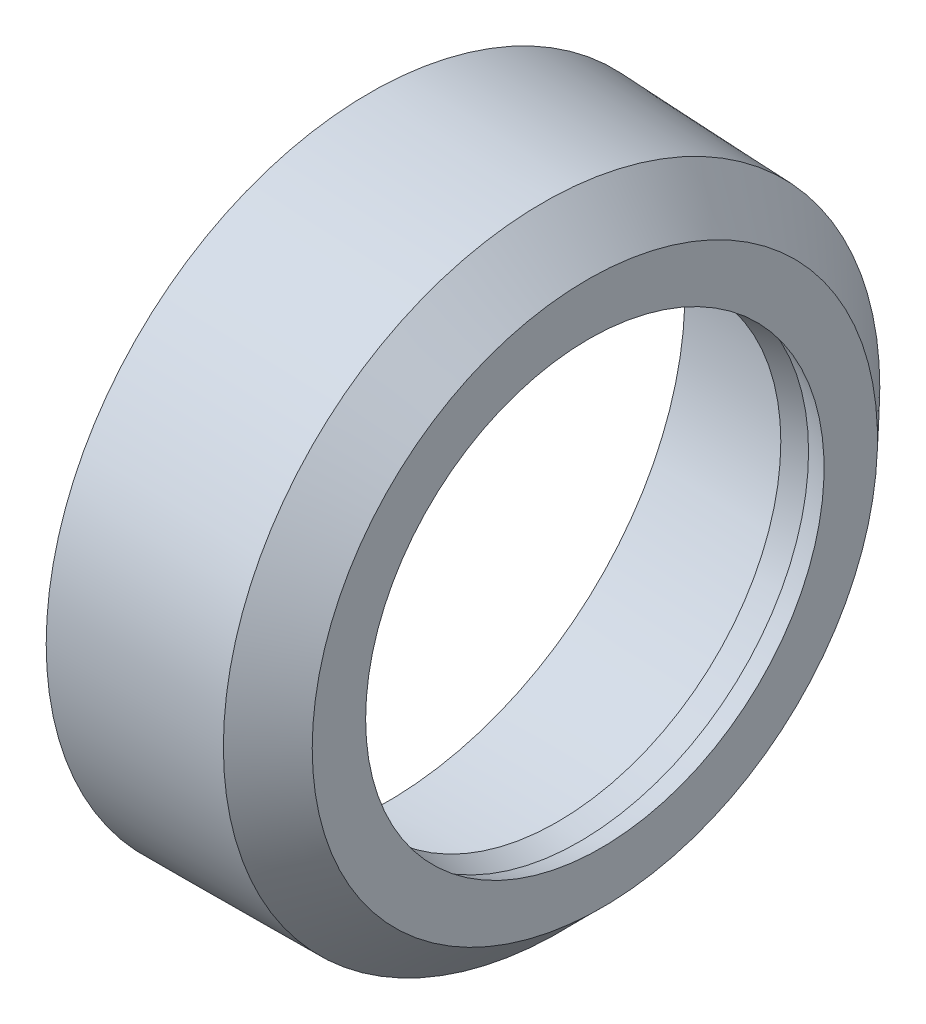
ISO-10303-21;
HEADER;
FILE_DESCRIPTION(('STEP AP214'),'2;1');
FILE_NAME('part.step','',(''),(''),'','','');
FILE_SCHEMA(('AUTOMOTIVE_DESIGN { 1 0 10303 214 1 1 1 1 }'));
ENDSEC;
DATA;
#1=APPLICATION_CONTEXT('core data for automotive mechanical design processes');
#2=APPLICATION_PROTOCOL_DEFINITION('international standard','automotive_design',2000,#1);
#3=PRODUCT_CONTEXT('',#1,'mechanical');
#4=PRODUCT('Part','Part','',(#3));
#5=PRODUCT_RELATED_PRODUCT_CATEGORY('part','',(#4));
#6=PRODUCT_DEFINITION_FORMATION('','',#4);
#7=PRODUCT_DEFINITION_CONTEXT('part definition',#1,'design');
#8=PRODUCT_DEFINITION('design','',#6,#7);
#9=PRODUCT_DEFINITION_SHAPE('','',#8);
#10=(LENGTH_UNIT() NAMED_UNIT(*) SI_UNIT(.MILLI.,.METRE.));
#11=(NAMED_UNIT(*) PLANE_ANGLE_UNIT() SI_UNIT($,.RADIAN.));
#12=(NAMED_UNIT(*) SI_UNIT($,.STERADIAN.) SOLID_ANGLE_UNIT());
#13=UNCERTAINTY_MEASURE_WITH_UNIT(LENGTH_MEASURE(1.E-05),#10,'distance_accuracy_value','');
#14=(GEOMETRIC_REPRESENTATION_CONTEXT(3) GLOBAL_UNCERTAINTY_ASSIGNED_CONTEXT((#13)) GLOBAL_UNIT_ASSIGNED_CONTEXT((#10,
#11,#12)) REPRESENTATION_CONTEXT('',''));
#15=CARTESIAN_POINT('',(0.,0.,0.));
#16=DIRECTION('',(0.,0.,1.));
#17=DIRECTION('',(1.,0.,0.));
#18=AXIS2_PLACEMENT_3D('',#15,#16,#17);
#19=CARTESIAN_POINT('',(79.7226716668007,-31.75,-35.1496237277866));
#20=DIRECTION('',(-0.999657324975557,0.,-0.0261769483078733));
#21=DIRECTION('',(-0.0261769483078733,0.,0.999657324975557));
#22=AXIS2_PLACEMENT_3D('',#19,#20,#21);
#23=CONICAL_SURFACE('',#22,18.0689110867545,0.261799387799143);
#24=CARTESIAN_POINT('',(81.4720719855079,-31.75,-35.1038140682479));
#25=DIRECTION('',(0.999657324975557,0.,0.0261769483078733));
#26=DIRECTION('',(0.0261769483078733,0.,-0.999657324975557));
#27=AXIS2_PLACEMENT_3D('',#24,#25,#26);
#28=CIRCLE('',#27,17.6);
#29=CARTESIAN_POINT('',(81.0113576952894,-31.75,-17.509845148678));
#30=VERTEX_POINT('',#29);
#31=EDGE_CURVE('E10',#30,#30,#28,.T.);
#32=CARTESIAN_POINT('',(79.7226716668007,-31.75,-35.1496237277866));
#33=DIRECTION('',(0.999657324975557,0.,0.0261769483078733));
#34=DIRECTION('',(0.0261769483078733,0.,-0.999657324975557));
#35=AXIS2_PLACEMENT_3D('',#32,#33,#34);
#36=CIRCLE('',#35,18.0689110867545);
#37=CARTESIAN_POINT('',(79.2496827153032,-31.75,-17.0869044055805));
#38=VERTEX_POINT('',#37);
#39=EDGE_CURVE('E55',#38,#38,#36,.T.);
#40=CARTESIAN_POINT('',(81.0113576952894,-31.75,-17.509845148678));
#41=CARTESIAN_POINT('',(80.9930069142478,-31.75,-17.5054395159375));
#42=CARTESIAN_POINT('',(80.9746561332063,-31.75,-17.5010338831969));
#43=CARTESIAN_POINT('',(80.9379545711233,-31.75,-17.4922226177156));
#44=CARTESIAN_POINT('',(80.9196037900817,-31.75,-17.487816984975));
#45=CARTESIAN_POINT('',(80.8829022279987,-31.75,-17.4790057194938));
#46=CARTESIAN_POINT('',(80.8645514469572,-31.75,-17.4746000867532));
#47=CARTESIAN_POINT('',(80.8278498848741,-31.75,-17.4657888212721));
#48=CARTESIAN_POINT('',(80.8094991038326,-31.75,-17.4613831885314));
#49=CARTESIAN_POINT('',(80.7727975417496,-31.75,-17.4525719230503));
#50=CARTESIAN_POINT('',(80.754446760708,-31.75,-17.4481662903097));
#51=CARTESIAN_POINT('',(80.717745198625,-31.75,-17.4393550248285));
#52=CARTESIAN_POINT('',(80.6993944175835,-31.75,-17.4349493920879));
#53=CARTESIAN_POINT('',(80.6626928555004,-31.75,-17.4261381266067));
#54=CARTESIAN_POINT('',(80.6443420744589,-31.75,-17.4217324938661));
#55=CARTESIAN_POINT('',(80.6076405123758,-31.75,-17.4129212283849));
#56=CARTESIAN_POINT('',(80.5892897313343,-31.75,-17.4085155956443));
#57=CARTESIAN_POINT('',(80.5525881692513,-31.75,-17.3997043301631));
#58=CARTESIAN_POINT('',(80.5342373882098,-31.75,-17.3952986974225));
#59=CARTESIAN_POINT('',(80.4975358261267,-31.75,-17.3864874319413));
#60=CARTESIAN_POINT('',(80.4791850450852,-31.75,-17.3820817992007));
#61=CARTESIAN_POINT('',(80.4424834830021,-31.75,-17.3732705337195));
#62=CARTESIAN_POINT('',(80.4241327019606,-31.75,-17.3688649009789));
#63=CARTESIAN_POINT('',(80.3874311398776,-31.75,-17.3600536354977));
#64=CARTESIAN_POINT('',(80.3690803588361,-31.75,-17.3556480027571));
#65=CARTESIAN_POINT('',(80.332378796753,-31.75,-17.3468367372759));
#66=CARTESIAN_POINT('',(80.3140280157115,-31.75,-17.3424311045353));
#67=CARTESIAN_POINT('',(80.2773264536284,-31.75,-17.3336198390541));
#68=CARTESIAN_POINT('',(80.2589756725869,-31.75,-17.3292142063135));
#69=CARTESIAN_POINT('',(80.2222741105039,-31.75,-17.3204029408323));
#70=CARTESIAN_POINT('',(80.2039233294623,-31.75,-17.3159973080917));
#71=CARTESIAN_POINT('',(80.1672217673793,-31.75,-17.3071860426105));
#72=CARTESIAN_POINT('',(80.1488709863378,-31.75,-17.3027804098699));
#73=CARTESIAN_POINT('',(80.1121694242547,-31.75,-17.2939691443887));
#74=CARTESIAN_POINT('',(80.0938186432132,-31.75,-17.2895635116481));
#75=CARTESIAN_POINT('',(80.0571170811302,-31.75,-17.2807522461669));
#76=CARTESIAN_POINT('',(80.0387663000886,-31.75,-17.2763466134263));
#77=CARTESIAN_POINT('',(80.0020647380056,-31.75,-17.2675353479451));
#78=CARTESIAN_POINT('',(79.9837139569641,-31.75,-17.2631297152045));
#79=CARTESIAN_POINT('',(79.947012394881,-31.75,-17.2543184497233));
#80=CARTESIAN_POINT('',(79.9286616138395,-31.75,-17.2499128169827));
#81=CARTESIAN_POINT('',(79.8919600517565,-31.75,-17.2411015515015));
#82=CARTESIAN_POINT('',(79.8736092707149,-31.75,-17.2366959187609));
#83=CARTESIAN_POINT('',(79.8369077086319,-31.75,-17.2278846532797));
#84=CARTESIAN_POINT('',(79.8185569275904,-31.75,-17.2234790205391));
#85=CARTESIAN_POINT('',(79.7818553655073,-31.75,-17.2146677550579));
#86=CARTESIAN_POINT('',(79.7635045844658,-31.75,-17.2102621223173));
#87=CARTESIAN_POINT('',(79.7268030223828,-31.75,-17.2014508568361));
#88=CARTESIAN_POINT('',(79.7084522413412,-31.75,-17.1970452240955));
#89=CARTESIAN_POINT('',(79.6717506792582,-31.75,-17.1882339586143));
#90=CARTESIAN_POINT('',(79.6533998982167,-31.75,-17.1838283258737));
#91=CARTESIAN_POINT('',(79.6166983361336,-31.75,-17.1750170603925));
#92=CARTESIAN_POINT('',(79.5983475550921,-31.75,-17.1706114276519));
#93=CARTESIAN_POINT('',(79.5616459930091,-31.75,-17.1618001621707));
#94=CARTESIAN_POINT('',(79.5432952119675,-31.75,-17.1573945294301));
#95=CARTESIAN_POINT('',(79.5065936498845,-31.75,-17.1485832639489));
#96=CARTESIAN_POINT('',(79.488242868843,-31.75,-17.1441776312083));
#97=CARTESIAN_POINT('',(79.4515413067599,-31.75,-17.1353663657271));
#98=CARTESIAN_POINT('',(79.4331905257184,-31.75,-17.1309607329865));
#99=CARTESIAN_POINT('',(79.3964889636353,-31.75,-17.1221494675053));
#100=CARTESIAN_POINT('',(79.3781381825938,-31.75,-17.1177438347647));
#101=CARTESIAN_POINT('',(79.3414366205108,-31.75,-17.1089325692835));
#102=CARTESIAN_POINT('',(79.3230858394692,-31.75,-17.1045269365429));
#103=CARTESIAN_POINT('',(79.2863842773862,-31.75,-17.0957156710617));
#104=CARTESIAN_POINT('',(79.2680334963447,-31.75,-17.0913100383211));
#105=CARTESIAN_POINT('',(79.2496827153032,-31.75,-17.0869044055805));
#106=B_SPLINE_CURVE_WITH_KNOTS('',3,(#40,#41,#42,#43,#44,#45,#46,#47,#48,#49,#50,#51,#52,#53,
#54,#55,#56,#57,#58,#59,#60,#61,#62,#63,#64,#65,#66,#67,#68,#69,#70,#71,#72,#73,#74,#75,#76,#77,
#78,#79,#80,#81,#82,#83,#84,#85,#86,#87,#88,#89,#90,#91,#92,#93,#94,#95,#96,#97,#98,#99,#100,
#101,#102,#103,#104,#105),.UNSPECIFIED.,.F.,.F.,(4,2,2,2,2,2,2,2,2,2,2,2,2,2,2,2,2,2,2,2,2,2,2,
2,2,2,2,2,2,2,2,2,4),(0.,0.0566166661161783,0.113233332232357,0.169849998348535,
0.226466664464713,0.283083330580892,0.33969999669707,0.396316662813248,0.452933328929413,
0.509549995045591,0.56616666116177,0.622783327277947,0.679399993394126,0.736016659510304,
0.792633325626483,0.849249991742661,0.905866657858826,0.962483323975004,1.01909999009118,
1.07571665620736,1.13233332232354,1.18894998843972,1.2455666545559,1.30218332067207,
1.35879998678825,1.41541665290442,1.47203331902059,1.52864998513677,1.58526665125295,
1.64188331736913,1.69849998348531,1.75511664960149,1.81173331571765),.UNSPECIFIED.);
#107=EDGE_CURVE('BSEAM27',#30,#38,#106,.T.);
#108=ORIENTED_EDGE('',*,*,#31,.T.);
#109=ORIENTED_EDGE('',*,*,#39,.F.);
#110=ORIENTED_EDGE('',*,*,#107,.T.);
#111=ORIENTED_EDGE('',*,*,#107,.F.);
#112=EDGE_LOOP('',(#108,#110,#109,#111));
#113=FACE_BOUND('',#112,.T.);
#114=ADVANCED_FACE('F27',(#113),#23,.F.);
#115=CARTESIAN_POINT('',(81.4720719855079,-10.0494835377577,-35.1038140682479));
#116=DIRECTION('',(0.999657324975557,0.,0.0261769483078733));
#117=DIRECTION('',(0.0261769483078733,0.,-0.999657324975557));
#118=AXIS2_PLACEMENT_3D('',#115,#116,#117);
#119=PLANE('',#118);
#120=CARTESIAN_POINT('',(81.4720719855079,-31.75,-35.1038140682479));
#121=DIRECTION('',(0.999657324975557,0.,0.0261769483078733));
#122=DIRECTION('',(0.0261769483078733,0.,-0.999657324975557));
#123=AXIS2_PLACEMENT_3D('',#120,#121,#122);
#124=CIRCLE('',#123,21.7005164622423);
#125=CARTESIAN_POINT('',(80.9040186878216,-31.75,-13.4107338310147));
#126=VERTEX_POINT('',#125);
#127=EDGE_CURVE('E33',#126,#126,#124,.T.);
#128=ORIENTED_EDGE('',*,*,#127,.T.);
#129=EDGE_LOOP('',(#128));
#130=FACE_BOUND('',#129,.T.);
#131=ORIENTED_EDGE('',*,*,#31,.F.);
#132=EDGE_LOOP('',(#131));
#133=FACE_BOUND('',#132,.T.);
#134=ADVANCED_FACE('F63',(#130,#133),#119,.T.);
#135=CARTESIAN_POINT('',(81.4720719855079,-31.75,-35.1038140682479));
#136=DIRECTION('',(-0.999657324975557,0.,-0.0261769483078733));
#137=DIRECTION('',(-0.0261769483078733,0.,0.999657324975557));
#138=AXIS2_PLACEMENT_3D('',#135,#136,#137);
#139=CONICAL_SURFACE('',#138,21.7005164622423,0.785398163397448);
#140=CARTESIAN_POINT('',(77.9732713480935,-31.75,-35.1954333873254));
#141=DIRECTION('',(0.999657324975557,0.,0.0261769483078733));
#142=DIRECTION('',(0.0261769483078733,0.,-0.999657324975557));
#143=AXIS2_PLACEMENT_3D('',#140,#141,#142);
#144=CIRCLE('',#143,25.2005164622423);
#145=CARTESIAN_POINT('',(77.3135987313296,-31.75,-10.0035525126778));
#146=VERTEX_POINT('',#145);
#147=EDGE_CURVE('E37',#146,#146,#144,.T.);
#148=CARTESIAN_POINT('',(77.3135987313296,-31.75,-10.0035525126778));
#149=CARTESIAN_POINT('',(77.3509989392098,-31.75,-10.0390439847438));
#150=CARTESIAN_POINT('',(77.3883991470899,-31.75,-10.0745354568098));
#151=CARTESIAN_POINT('',(77.4631995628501,-31.75,-10.1455184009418));
#152=CARTESIAN_POINT('',(77.5005997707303,-31.75,-10.1810098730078));
#153=CARTESIAN_POINT('',(77.5754001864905,-31.75,-10.2519928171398));
#154=CARTESIAN_POINT('',(77.6128003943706,-31.75,-10.2874842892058));
#155=CARTESIAN_POINT('',(77.6876008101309,-31.75,-10.3584672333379));
#156=CARTESIAN_POINT('',(77.725001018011,-31.75,-10.3939587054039));
#157=CARTESIAN_POINT('',(77.7998014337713,-31.75,-10.4649416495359));
#158=CARTESIAN_POINT('',(77.8372016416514,-31.75,-10.5004331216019));
#159=CARTESIAN_POINT('',(77.9120020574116,-31.75,-10.5714160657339));
#160=CARTESIAN_POINT('',(77.9494022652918,-31.75,-10.6069075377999));
#161=CARTESIAN_POINT('',(78.024202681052,-31.75,-10.6778904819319));
#162=CARTESIAN_POINT('',(78.0616028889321,-31.75,-10.713381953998));
#163=CARTESIAN_POINT('',(78.1364033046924,-31.75,-10.78436489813));
#164=CARTESIAN_POINT('',(78.1738035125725,-31.75,-10.819856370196));
#165=CARTESIAN_POINT('',(78.2486039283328,-31.75,-10.890839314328));
#166=CARTESIAN_POINT('',(78.2860041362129,-31.75,-10.926330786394));
#167=CARTESIAN_POINT('',(78.3608045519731,-31.75,-10.997313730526));
#168=CARTESIAN_POINT('',(78.3982047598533,-31.75,-11.032805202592));
#169=CARTESIAN_POINT('',(78.4730051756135,-31.75,-11.1037881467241));
#170=CARTESIAN_POINT('',(78.5104053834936,-31.75,-11.1392796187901));
#171=CARTESIAN_POINT('',(78.5852057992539,-31.75,-11.2102625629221));
#172=CARTESIAN_POINT('',(78.622606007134,-31.75,-11.2457540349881));
#173=CARTESIAN_POINT('',(78.6974064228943,-31.75,-11.3167369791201));
#174=CARTESIAN_POINT('',(78.7348066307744,-31.75,-11.3522284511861));
#175=CARTESIAN_POINT('',(78.8096070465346,-31.75,-11.4232113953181));
#176=CARTESIAN_POINT('',(78.8470072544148,-31.75,-11.4587028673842));
#177=CARTESIAN_POINT('',(78.921807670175,-31.75,-11.5296858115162));
#178=CARTESIAN_POINT('',(78.9592078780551,-31.75,-11.5651772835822));
#179=CARTESIAN_POINT('',(79.0340082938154,-31.75,-11.6361602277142));
#180=CARTESIAN_POINT('',(79.0714085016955,-31.75,-11.6716516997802));
#181=CARTESIAN_POINT('',(79.1462089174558,-31.75,-11.7426346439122));
#182=CARTESIAN_POINT('',(79.1836091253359,-31.75,-11.7781261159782));
#183=CARTESIAN_POINT('',(79.2584095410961,-31.75,-11.8491090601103));
#184=CARTESIAN_POINT('',(79.2958097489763,-31.75,-11.8846005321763));
#185=CARTESIAN_POINT('',(79.3706101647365,-31.75,-11.9555834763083));
#186=CARTESIAN_POINT('',(79.4080103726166,-31.75,-11.9910749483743));
#187=CARTESIAN_POINT('',(79.4828107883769,-31.75,-12.0620578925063));
#188=CARTESIAN_POINT('',(79.520210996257,-31.75,-12.0975493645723));
#189=CARTESIAN_POINT('',(79.5950114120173,-31.75,-12.1685323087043));
#190=CARTESIAN_POINT('',(79.6324116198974,-31.75,-12.2040237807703));
#191=CARTESIAN_POINT('',(79.7072120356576,-31.75,-12.2750067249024));
#192=CARTESIAN_POINT('',(79.7446122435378,-31.75,-12.3104981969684));
#193=CARTESIAN_POINT('',(79.819412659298,-31.75,-12.3814811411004));
#194=CARTESIAN_POINT('',(79.8568128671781,-31.75,-12.4169726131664));
#195=CARTESIAN_POINT('',(79.9316132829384,-31.75,-12.4879555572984));
#196=CARTESIAN_POINT('',(79.9690134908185,-31.75,-12.5234470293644));
#197=CARTESIAN_POINT('',(80.0438139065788,-31.75,-12.5944299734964));
#198=CARTESIAN_POINT('',(80.0812141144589,-31.75,-12.6299214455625));
#199=CARTESIAN_POINT('',(80.1560145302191,-31.75,-12.7009043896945));
#200=CARTESIAN_POINT('',(80.1934147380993,-31.75,-12.7363958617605));
#201=CARTESIAN_POINT('',(80.2682151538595,-31.75,-12.8073788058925));
#202=CARTESIAN_POINT('',(80.3056153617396,-31.75,-12.8428702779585));
#203=CARTESIAN_POINT('',(80.3804157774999,-31.75,-12.9138532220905));
#204=CARTESIAN_POINT('',(80.41781598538,-31.75,-12.9493446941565));
#205=CARTESIAN_POINT('',(80.4926164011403,-31.75,-13.0203276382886));
#206=CARTESIAN_POINT('',(80.5300166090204,-31.75,-13.0558191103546));
#207=CARTESIAN_POINT('',(80.6048170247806,-31.75,-13.1268020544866));
#208=CARTESIAN_POINT('',(80.6422172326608,-31.75,-13.1622935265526));
#209=CARTESIAN_POINT('',(80.717017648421,-31.75,-13.2332764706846));
#210=CARTESIAN_POINT('',(80.7544178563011,-31.75,-13.2687679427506));
#211=CARTESIAN_POINT('',(80.8292182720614,-31.75,-13.3397508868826));
#212=CARTESIAN_POINT('',(80.8666184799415,-31.75,-13.3752423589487));
#213=CARTESIAN_POINT('',(80.9040186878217,-31.75,-13.4107338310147));
#214=B_SPLINE_CURVE_WITH_KNOTS('',3,(#148,#149,#150,#151,#152,#153,#154,#155,#156,#157,#158,
#159,#160,#161,#162,#163,#164,#165,#166,#167,#168,#169,#170,#171,#172,#173,#174,#175,#176,#177,
#178,#179,#180,#181,#182,#183,#184,#185,#186,#187,#188,#189,#190,#191,#192,#193,#194,#195,#196,
#197,#198,#199,#200,#201,#202,#203,#204,#205,#206,#207,#208,#209,#210,#211,#212,#213),
.UNSPECIFIED.,.F.,.F.,(4,2,2,2,2,2,2,2,2,2,2,2,2,2,2,2,2,2,2,2,2,2,2,2,2,2,2,2,2,2,2,2,4),(0.,
0.15467960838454,0.309359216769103,0.464038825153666,0.618718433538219,0.773398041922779,
0.92807765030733,1.08275725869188,1.23743686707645,1.39211647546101,1.54679608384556,
1.70147569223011,1.85615530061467,2.01083490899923,2.16551451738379,2.32019412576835,
2.47487373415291,2.62955334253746,2.78423295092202,2.93891255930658,3.09359216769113,
3.2482717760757,3.40295138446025,3.5576309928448,3.71231060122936,3.86699020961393,
4.02166981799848,4.17634942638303,4.33102903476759,4.48570864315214,4.6403882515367,
4.79506785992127,4.94974746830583),.UNSPECIFIED.);
#215=EDGE_CURVE('BSEAM67',#146,#126,#214,.T.);
#216=ORIENTED_EDGE('',*,*,#147,.T.);
#217=ORIENTED_EDGE('',*,*,#127,.F.);
#218=ORIENTED_EDGE('',*,*,#215,.T.);
#219=ORIENTED_EDGE('',*,*,#215,.F.);
#220=EDGE_LOOP('',(#216,#218,#217,#219));
#221=FACE_BOUND('',#220,.T.);
#222=ADVANCED_FACE('F67',(#221),#139,.T.);
#223=CARTESIAN_POINT('',(77.9732713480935,-31.75,-35.1954333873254));
#224=DIRECTION('',(-0.999657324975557,0.,-0.0261769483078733));
#225=DIRECTION('',(-0.0261769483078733,0.,0.999657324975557));
#226=AXIS2_PLACEMENT_3D('',#223,#224,#225);
#227=CONICAL_SURFACE('',#226,25.2005164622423,0.0227233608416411);
#228=CARTESIAN_POINT('',(63.9780687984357,-31.75,-35.5619106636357));
#229=DIRECTION('',(0.999657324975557,0.,0.0261769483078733));
#230=DIRECTION('',(0.0261769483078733,0.,-0.999657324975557));
#231=AXIS2_PLACEMENT_3D('',#228,#229,#230);
#232=CIRCLE('',#231,25.5186982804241);
#233=CARTESIAN_POINT('',(63.3100671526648,-31.75,-10.0519570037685));
#234=VERTEX_POINT('',#233);
#235=EDGE_CURVE('E41',#234,#234,#232,.T.);
#236=CARTESIAN_POINT('',(63.3100671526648,-31.75,-10.0519570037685));
#237=CARTESIAN_POINT('',(63.4559372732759,-31.75,-10.0514527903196));
#238=CARTESIAN_POINT('',(63.601807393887,-31.75,-10.0509485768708));
#239=CARTESIAN_POINT('',(63.8935476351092,-31.75,-10.0499401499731));
#240=CARTESIAN_POINT('',(64.0394177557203,-31.75,-10.0494359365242));
#241=CARTESIAN_POINT('',(64.3311579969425,-31.75,-10.0484275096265));
#242=CARTESIAN_POINT('',(64.4770281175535,-31.75,-10.0479232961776));
#243=CARTESIAN_POINT('',(64.7687683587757,-31.75,-10.0469148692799));
#244=CARTESIAN_POINT('',(64.9146384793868,-31.75,-10.046410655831));
#245=CARTESIAN_POINT('',(65.206378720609,-31.75,-10.0454022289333));
#246=CARTESIAN_POINT('',(65.3522488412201,-31.75,-10.0448980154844));
#247=CARTESIAN_POINT('',(65.6439890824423,-31.75,-10.0438895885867));
#248=CARTESIAN_POINT('',(65.7898592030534,-31.75,-10.0433853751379));
#249=CARTESIAN_POINT('',(66.0815994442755,-31.75,-10.0423769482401));
#250=CARTESIAN_POINT('',(66.2274695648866,-31.75,-10.0418727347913));
#251=CARTESIAN_POINT('',(66.5192098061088,-31.75,-10.0408643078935));
#252=CARTESIAN_POINT('',(66.6650799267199,-31.75,-10.0403600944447));
#253=CARTESIAN_POINT('',(66.9568201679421,-31.75,-10.039351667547));
#254=CARTESIAN_POINT('',(67.1026902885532,-31.75,-10.0388474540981));
#255=CARTESIAN_POINT('',(67.3944305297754,-31.75,-10.0378390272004));
#256=CARTESIAN_POINT('',(67.5403006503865,-31.75,-10.0373348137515));
#257=CARTESIAN_POINT('',(67.8320408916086,-31.75,-10.0363263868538));
#258=CARTESIAN_POINT('',(67.9779110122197,-31.75,-10.0358221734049));
#259=CARTESIAN_POINT('',(68.2696512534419,-31.75,-10.0348137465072));
#260=CARTESIAN_POINT('',(68.415521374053,-31.75,-10.0343095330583));
#261=CARTESIAN_POINT('',(68.7072616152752,-31.75,-10.0333011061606));
#262=CARTESIAN_POINT('',(68.8531317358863,-31.75,-10.0327968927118));
#263=CARTESIAN_POINT('',(69.1448719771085,-31.75,-10.031788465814));
#264=CARTESIAN_POINT('',(69.2907420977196,-31.75,-10.0312842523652));
#265=CARTESIAN_POINT('',(69.5824823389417,-31.75,-10.0302758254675));
#266=CARTESIAN_POINT('',(69.7283524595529,-31.75,-10.0297716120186));
#267=CARTESIAN_POINT('',(70.020092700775,-31.75,-10.0287631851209));
#268=CARTESIAN_POINT('',(70.1659628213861,-31.75,-10.028258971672));
#269=CARTESIAN_POINT('',(70.4577030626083,-31.75,-10.0272505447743));
#270=CARTESIAN_POINT('',(70.6035731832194,-31.75,-10.0267463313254));
#271=CARTESIAN_POINT('',(70.8953134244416,-31.75,-10.0257379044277));
#272=CARTESIAN_POINT('',(71.0411835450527,-31.75,-10.0252336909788));
#273=CARTESIAN_POINT('',(71.3329237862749,-31.75,-10.0242252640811));
#274=CARTESIAN_POINT('',(71.4787939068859,-31.75,-10.0237210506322));
#275=CARTESIAN_POINT('',(71.7705341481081,-31.75,-10.0227126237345));
#276=CARTESIAN_POINT('',(71.9164042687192,-31.75,-10.0222084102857));
#277=CARTESIAN_POINT('',(72.2081445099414,-31.75,-10.0211999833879));
#278=CARTESIAN_POINT('',(72.3540146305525,-31.75,-10.0206957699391));
#279=CARTESIAN_POINT('',(72.6457548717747,-31.75,-10.0196873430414));
#280=CARTESIAN_POINT('',(72.7916249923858,-31.75,-10.0191831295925));
#281=CARTESIAN_POINT('',(73.083365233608,-31.75,-10.0181747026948));
#282=CARTESIAN_POINT('',(73.229235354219,-31.75,-10.0176704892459));
#283=CARTESIAN_POINT('',(73.5209755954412,-31.75,-10.0166620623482));
#284=CARTESIAN_POINT('',(73.6668457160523,-31.75,-10.0161578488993));
#285=CARTESIAN_POINT('',(73.9585859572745,-31.75,-10.0151494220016));
#286=CARTESIAN_POINT('',(74.1044560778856,-31.75,-10.0146452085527));
#287=CARTESIAN_POINT('',(74.3961963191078,-31.75,-10.013636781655));
#288=CARTESIAN_POINT('',(74.5420664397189,-31.75,-10.0131325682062));
#289=CARTESIAN_POINT('',(74.8338066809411,-31.75,-10.0121241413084));
#290=CARTESIAN_POINT('',(74.9796768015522,-31.75,-10.0116199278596));
#291=CARTESIAN_POINT('',(75.2714170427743,-31.75,-10.0106115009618));
#292=CARTESIAN_POINT('',(75.4172871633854,-31.75,-10.010107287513));
#293=CARTESIAN_POINT('',(75.7090274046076,-31.75,-10.0090988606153));
#294=CARTESIAN_POINT('',(75.8548975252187,-31.75,-10.0085946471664));
#295=CARTESIAN_POINT('',(76.1466377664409,-31.75,-10.0075862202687));
#296=CARTESIAN_POINT('',(76.292507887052,-31.75,-10.0070820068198));
#297=CARTESIAN_POINT('',(76.5842481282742,-31.75,-10.0060735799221));
#298=CARTESIAN_POINT('',(76.7301182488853,-31.75,-10.0055693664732));
#299=CARTESIAN_POINT('',(77.0218584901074,-31.75,-10.0045609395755));
#300=CARTESIAN_POINT('',(77.1677286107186,-31.75,-10.0040567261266));
#301=CARTESIAN_POINT('',(77.3135987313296,-31.75,-10.0035525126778));
#302=B_SPLINE_CURVE_WITH_KNOTS('',3,(#236,#237,#238,#239,#240,#241,#242,#243,#244,#245,#246,
#247,#248,#249,#250,#251,#252,#253,#254,#255,#256,#257,#258,#259,#260,#261,#262,#263,#264,#265,
#266,#267,#268,#269,#270,#271,#272,#273,#274,#275,#276,#277,#278,#279,#280,#281,#282,#283,#284,
#285,#286,#287,#288,#289,#290,#291,#292,#293,#294,#295,#296,#297,#298,#299,#300,#301),
.UNSPECIFIED.,.F.,.F.,(4,2,2,2,2,2,2,2,2,2,2,2,2,2,2,2,2,2,2,2,2,2,2,2,2,2,2,2,2,2,2,2,4),(0.,
0.437612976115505,0.87522595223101,1.31283892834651,1.75045190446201,2.18806488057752,
2.62567785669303,3.06329083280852,3.50090380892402,3.93851678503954,4.37612976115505,
4.81374273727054,5.25135571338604,5.68896868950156,6.12658166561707,6.56419464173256,
7.00180761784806,7.43942059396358,7.87703357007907,8.31464654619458,8.75225952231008,
9.1898724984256,9.62748547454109,10.0650984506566,10.5027114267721,10.9403244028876,
11.3779373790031,11.8155503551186,12.2531633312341,12.6907763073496,13.1283892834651,
13.5660022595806,14.0036152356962),.UNSPECIFIED.);
#303=EDGE_CURVE('BSEAM71',#234,#146,#302,.T.);
#304=ORIENTED_EDGE('',*,*,#235,.T.);
#305=ORIENTED_EDGE('',*,*,#147,.F.);
#306=ORIENTED_EDGE('',*,*,#303,.T.);
#307=ORIENTED_EDGE('',*,*,#303,.F.);
#308=EDGE_LOOP('',(#304,#306,#305,#307));
#309=FACE_BOUND('',#308,.T.);
#310=ADVANCED_FACE('F71',(#309),#227,.T.);
#311=CARTESIAN_POINT('',(63.9780687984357,-6.23130171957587,-35.5619106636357));
#312=DIRECTION('',(-0.999657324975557,0.,-0.0261769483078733));
#313=DIRECTION('',(-0.0261769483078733,0.,0.999657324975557));
#314=AXIS2_PLACEMENT_3D('',#311,#312,#313);
#315=PLANE('',#314);
#316=CARTESIAN_POINT('',(63.9780687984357,-31.75,-35.5619106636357));
#317=DIRECTION('',(0.999657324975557,0.,0.0261769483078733));
#318=DIRECTION('',(0.0261769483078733,0.,-0.999657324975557));
#319=AXIS2_PLACEMENT_3D('',#316,#317,#318);
#320=CIRCLE('',#319,23.5181818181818);
#321=CARTESIAN_POINT('',(63.362434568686,-31.75,-12.0517879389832));
#322=VERTEX_POINT('',#321);
#323=EDGE_CURVE('E46',#322,#322,#320,.T.);
#324=ORIENTED_EDGE('',*,*,#323,.T.);
#325=EDGE_LOOP('',(#324));
#326=FACE_BOUND('',#325,.T.);
#327=ORIENTED_EDGE('',*,*,#235,.F.);
#328=EDGE_LOOP('',(#327));
#329=FACE_BOUND('',#328,.T.);
#330=ADVANCED_FACE('F78',(#326,#329),#315,.T.);
#331=CARTESIAN_POINT('',(63.9780687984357,-31.75,-35.5619106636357));
#332=DIRECTION('',(-0.999657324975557,0.,-0.0261769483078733));
#333=DIRECTION('',(-0.0261769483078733,0.,0.999657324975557));
#334=AXIS2_PLACEMENT_3D('',#331,#332,#333);
#335=CONICAL_SURFACE('',#334,23.5181818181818,0.0227233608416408);
#336=CARTESIAN_POINT('',(77.9732713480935,-31.75,-35.1954333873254));
#337=DIRECTION('',(0.999657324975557,0.,0.0261769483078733));
#338=DIRECTION('',(0.0261769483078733,0.,-0.999657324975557));
#339=AXIS2_PLACEMENT_3D('',#336,#337,#338);
#340=CIRCLE('',#339,23.2);
#341=CARTESIAN_POINT('',(77.3659661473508,-31.75,-12.0033834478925));
#342=VERTEX_POINT('',#341);
#343=EDGE_CURVE('E49',#342,#342,#340,.T.);
#344=CARTESIAN_POINT('',(77.3659661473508,-31.75,-12.0033834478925));
#345=CARTESIAN_POINT('',(77.2200960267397,-31.75,-12.0038876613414));
#346=CARTESIAN_POINT('',(77.0742259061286,-31.75,-12.0043918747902));
#347=CARTESIAN_POINT('',(76.7824856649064,-31.75,-12.0054003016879));
#348=CARTESIAN_POINT('',(76.6366155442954,-31.75,-12.0059045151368));
#349=CARTESIAN_POINT('',(76.3448753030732,-31.75,-12.0069129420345));
#350=CARTESIAN_POINT('',(76.1990051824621,-31.75,-12.0074171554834));
#351=CARTESIAN_POINT('',(75.9072649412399,-31.75,-12.0084255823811));
#352=CARTESIAN_POINT('',(75.7613948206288,-31.75,-12.00892979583));
#353=CARTESIAN_POINT('',(75.4696545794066,-31.75,-12.0099382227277));
#354=CARTESIAN_POINT('',(75.3237844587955,-31.75,-12.0104424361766));
#355=CARTESIAN_POINT('',(75.0320442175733,-31.75,-12.0114508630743));
#356=CARTESIAN_POINT('',(74.8861740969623,-31.75,-12.0119550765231));
#357=CARTESIAN_POINT('',(74.5944338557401,-31.75,-12.0129635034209));
#358=CARTESIAN_POINT('',(74.448563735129,-31.75,-12.0134677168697));
#359=CARTESIAN_POINT('',(74.1568234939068,-31.75,-12.0144761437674));
#360=CARTESIAN_POINT('',(74.0109533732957,-31.75,-12.0149803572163));
#361=CARTESIAN_POINT('',(73.7192131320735,-31.75,-12.015988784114));
#362=CARTESIAN_POINT('',(73.5733430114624,-31.75,-12.0164929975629));
#363=CARTESIAN_POINT('',(73.2816027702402,-31.75,-12.0175014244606));
#364=CARTESIAN_POINT('',(73.1357326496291,-31.75,-12.0180056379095));
#365=CARTESIAN_POINT('',(72.843992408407,-31.75,-12.0190140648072));
#366=CARTESIAN_POINT('',(72.6981222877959,-31.75,-12.0195182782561));
#367=CARTESIAN_POINT('',(72.4063820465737,-31.75,-12.0205267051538));
#368=CARTESIAN_POINT('',(72.2605119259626,-31.75,-12.0210309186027));
#369=CARTESIAN_POINT('',(71.9687716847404,-31.75,-12.0220393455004));
#370=CARTESIAN_POINT('',(71.8229015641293,-31.75,-12.0225435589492));
#371=CARTESIAN_POINT('',(71.5311613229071,-31.75,-12.023551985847));
#372=CARTESIAN_POINT('',(71.385291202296,-31.75,-12.0240561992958));
#373=CARTESIAN_POINT('',(71.0935509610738,-31.75,-12.0250646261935));
#374=CARTESIAN_POINT('',(70.9476808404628,-31.75,-12.0255688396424));
#375=CARTESIAN_POINT('',(70.6559405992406,-31.75,-12.0265772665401));
#376=CARTESIAN_POINT('',(70.5100704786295,-31.75,-12.027081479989));
#377=CARTESIAN_POINT('',(70.2183302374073,-31.75,-12.0280899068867));
#378=CARTESIAN_POINT('',(70.0724601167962,-31.75,-12.0285941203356));
#379=CARTESIAN_POINT('',(69.780719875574,-31.75,-12.0296025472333));
#380=CARTESIAN_POINT('',(69.6348497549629,-31.75,-12.0301067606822));
#381=CARTESIAN_POINT('',(69.3431095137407,-31.75,-12.0311151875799));
#382=CARTESIAN_POINT('',(69.1972393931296,-31.75,-12.0316194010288));
#383=CARTESIAN_POINT('',(68.9054991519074,-31.75,-12.0326278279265));
#384=CARTESIAN_POINT('',(68.7596290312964,-31.75,-12.0331320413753));
#385=CARTESIAN_POINT('',(68.4678887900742,-31.75,-12.0341404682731));
#386=CARTESIAN_POINT('',(68.3220186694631,-31.75,-12.0346446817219));
#387=CARTESIAN_POINT('',(68.0302784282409,-31.75,-12.0356531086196));
#388=CARTESIAN_POINT('',(67.8844083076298,-31.75,-12.0361573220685));
#389=CARTESIAN_POINT('',(67.5926680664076,-31.75,-12.0371657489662));
#390=CARTESIAN_POINT('',(67.4467979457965,-31.75,-12.0376699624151));
#391=CARTESIAN_POINT('',(67.1550577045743,-31.75,-12.0386783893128));
#392=CARTESIAN_POINT('',(67.0091875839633,-31.75,-12.0391826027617));
#393=CARTESIAN_POINT('',(66.7174473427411,-31.75,-12.0401910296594));
#394=CARTESIAN_POINT('',(66.57157722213,-31.75,-12.0406952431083));
#395=CARTESIAN_POINT('',(66.2798369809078,-31.75,-12.041703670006));
#396=CARTESIAN_POINT('',(66.1339668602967,-31.75,-12.0422078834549));
#397=CARTESIAN_POINT('',(65.8422266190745,-31.75,-12.0432163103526));
#398=CARTESIAN_POINT('',(65.6963564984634,-31.75,-12.0437205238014));
#399=CARTESIAN_POINT('',(65.4046162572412,-31.75,-12.0447289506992));
#400=CARTESIAN_POINT('',(65.2587461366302,-31.75,-12.045233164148));
#401=CARTESIAN_POINT('',(64.967005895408,-31.75,-12.0462415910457));
#402=CARTESIAN_POINT('',(64.8211357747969,-31.75,-12.0467458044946));
#403=CARTESIAN_POINT('',(64.5293955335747,-31.75,-12.0477542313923));
#404=CARTESIAN_POINT('',(64.3835254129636,-31.75,-12.0482584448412));
#405=CARTESIAN_POINT('',(64.0917851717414,-31.75,-12.0492668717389));
#406=CARTESIAN_POINT('',(63.9459150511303,-31.75,-12.0497710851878));
#407=CARTESIAN_POINT('',(63.6541748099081,-31.75,-12.0507795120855));
#408=CARTESIAN_POINT('',(63.508304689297,-31.75,-12.0512837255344));
#409=CARTESIAN_POINT('',(63.362434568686,-31.75,-12.0517879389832));
#410=B_SPLINE_CURVE_WITH_KNOTS('',3,(#344,#345,#346,#347,#348,#349,#350,#351,#352,#353,#354,
#355,#356,#357,#358,#359,#360,#361,#362,#363,#364,#365,#366,#367,#368,#369,#370,#371,#372,#373,
#374,#375,#376,#377,#378,#379,#380,#381,#382,#383,#384,#385,#386,#387,#388,#389,#390,#391,#392,
#393,#394,#395,#396,#397,#398,#399,#400,#401,#402,#403,#404,#405,#406,#407,#408,#409),
.UNSPECIFIED.,.F.,.F.,(4,2,2,2,2,2,2,2,2,2,2,2,2,2,2,2,2,2,2,2,2,2,2,2,2,2,2,2,2,2,2,2,4),(0.,
0.437612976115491,0.875225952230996,1.31283892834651,1.75045190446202,2.18806488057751,
2.62567785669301,3.06329083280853,3.50090380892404,3.93851678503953,4.37612976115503,
4.81374273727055,5.25135571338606,5.68896868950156,6.12658166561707,6.56419464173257,
7.00180761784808,7.43942059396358,7.8770335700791,8.31464654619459,8.7522595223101,
9.1898724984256,9.62748547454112,10.0650984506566,10.5027114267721,10.9403244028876,
11.3779373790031,11.8155503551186,12.2531633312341,12.6907763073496,13.1283892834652,
13.5660022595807,14.0036152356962),.UNSPECIFIED.);
#411=EDGE_CURVE('BSEAM82',#342,#322,#410,.T.);
#412=ORIENTED_EDGE('',*,*,#343,.T.);
#413=ORIENTED_EDGE('',*,*,#323,.F.);
#414=ORIENTED_EDGE('',*,*,#411,.T.);
#415=ORIENTED_EDGE('',*,*,#411,.F.);
#416=EDGE_LOOP('',(#412,#414,#413,#415));
#417=FACE_BOUND('',#416,.T.);
#418=ADVANCED_FACE('F82',(#417),#335,.F.);
#419=CARTESIAN_POINT('',(77.9732713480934,-14.15,-35.1954333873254));
#420=DIRECTION('',(-0.999657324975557,0.,-0.0261769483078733));
#421=DIRECTION('',(-0.0261769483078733,0.,0.999657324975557));
#422=AXIS2_PLACEMENT_3D('',#419,#420,#421);
#423=PLANE('',#422);
#424=CARTESIAN_POINT('',(77.9732713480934,-31.75,-35.1954333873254));
#425=DIRECTION('',(0.999657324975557,0.,0.0261769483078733));
#426=DIRECTION('',(0.0261769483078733,0.,-0.999657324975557));
#427=AXIS2_PLACEMENT_3D('',#424,#425,#426);
#428=CIRCLE('',#427,17.6);
#429=CARTESIAN_POINT('',(78.433985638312,-31.75,-52.7894023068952));
#430=VERTEX_POINT('',#429);
#431=EDGE_CURVE('E52',#430,#430,#428,.T.);
#432=ORIENTED_EDGE('',*,*,#431,.T.);
#433=EDGE_LOOP('',(#432));
#434=FACE_BOUND('',#433,.T.);
#435=ORIENTED_EDGE('',*,*,#343,.F.);
#436=EDGE_LOOP('',(#435));
#437=FACE_BOUND('',#436,.T.);
#438=ADVANCED_FACE('F86',(#434,#437),#423,.T.);
#439=CARTESIAN_POINT('',(77.9732713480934,-31.75,-35.1954333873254));
#440=DIRECTION('',(0.999657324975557,0.,0.0261769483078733));
#441=DIRECTION('',(0.0261769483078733,0.,-0.999657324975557));
#442=AXIS2_PLACEMENT_3D('',#439,#440,#441);
#443=CONICAL_SURFACE('',#442,17.6,0.261799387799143);
#444=ORIENTED_EDGE('',*,*,#39,.T.);
#445=EDGE_LOOP('',(#444));
#446=FACE_BOUND('',#445,.T.);
#447=ORIENTED_EDGE('',*,*,#431,.F.);
#448=EDGE_LOOP('',(#447));
#449=FACE_BOUND('',#448,.T.);
#450=ADVANCED_FACE('F59',(#446,#449),#443,.F.);
#451=CLOSED_SHELL('',(#114,#134,#222,#310,#330,#418,#438,#450));
#452=MANIFOLD_SOLID_BREP('B2',#451);
#453=ADVANCED_BREP_SHAPE_REPRESENTATION('',(#18,#452),#14);
#454=SHAPE_DEFINITION_REPRESENTATION(#9,#453);
ENDSEC;
END-ISO-10303-21;
